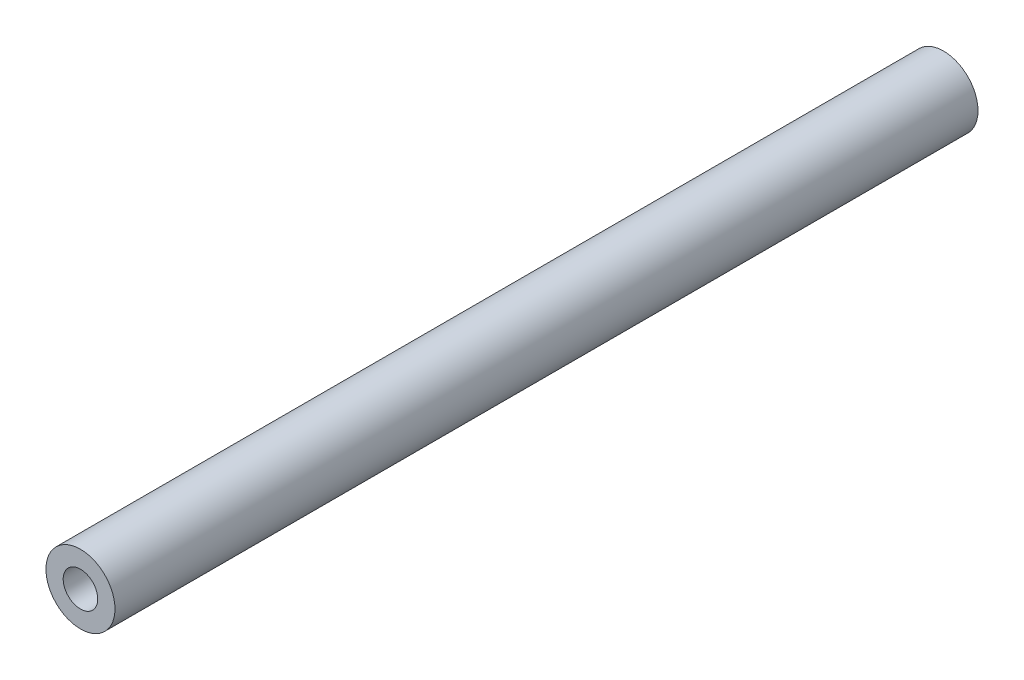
from build123d import *

# Parameters (mm, degrees)
SKETCH_1_R      = 2
SKETCH_1_R_2    = 1
EXTRUDE_1_DEPTH = 50


with BuildPart() as part:
    # Sketch 1 → Extrude 1 (new body)
    with BuildSketch(Plane.XY):
        Circle(SKETCH_1_R)
        Circle(SKETCH_1_R_2, mode=Mode.SUBTRACT)
    extrude(amount=EXTRUDE_1_DEPTH)


solid = part.part
